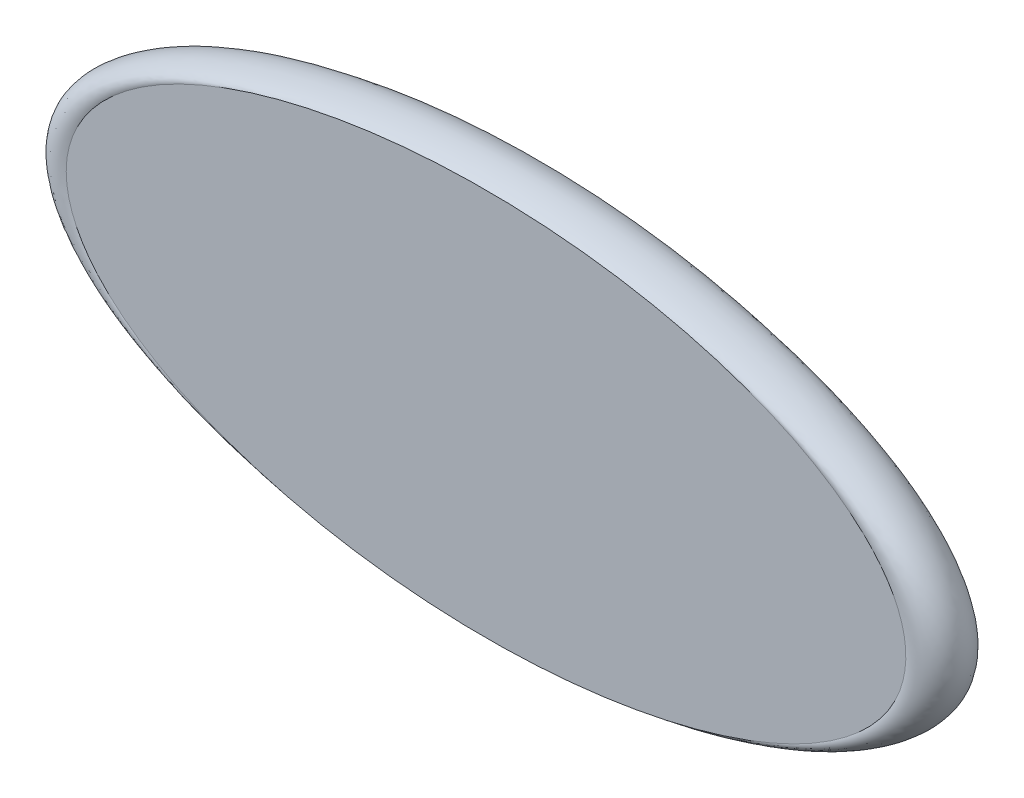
ISO-10303-21;
HEADER;
FILE_DESCRIPTION(('STEP AP214'),'2;1');
FILE_NAME('part.step','',(''),(''),'','','');
FILE_SCHEMA(('AUTOMOTIVE_DESIGN { 1 0 10303 214 1 1 1 1 }'));
ENDSEC;
DATA;
#1=APPLICATION_CONTEXT('core data for automotive mechanical design processes');
#2=APPLICATION_PROTOCOL_DEFINITION('international standard','automotive_design',2000,#1);
#3=PRODUCT_CONTEXT('',#1,'mechanical');
#4=PRODUCT('Part','Part','',(#3));
#5=PRODUCT_RELATED_PRODUCT_CATEGORY('part','',(#4));
#6=PRODUCT_DEFINITION_FORMATION('','',#4);
#7=PRODUCT_DEFINITION_CONTEXT('part definition',#1,'design');
#8=PRODUCT_DEFINITION('design','',#6,#7);
#9=PRODUCT_DEFINITION_SHAPE('','',#8);
#10=(LENGTH_UNIT() NAMED_UNIT(*) SI_UNIT(.MILLI.,.METRE.));
#11=(NAMED_UNIT(*) PLANE_ANGLE_UNIT() SI_UNIT($,.RADIAN.));
#12=(NAMED_UNIT(*) SI_UNIT($,.STERADIAN.) SOLID_ANGLE_UNIT());
#13=UNCERTAINTY_MEASURE_WITH_UNIT(LENGTH_MEASURE(1.E-05),#10,'distance_accuracy_value','');
#14=(GEOMETRIC_REPRESENTATION_CONTEXT(3) GLOBAL_UNCERTAINTY_ASSIGNED_CONTEXT((#13)) GLOBAL_UNIT_ASSIGNED_CONTEXT((#10,
#11,#12)) REPRESENTATION_CONTEXT('',''));
#15=CARTESIAN_POINT('',(0.,0.,0.));
#16=DIRECTION('',(0.,0.,1.));
#17=DIRECTION('',(1.,0.,0.));
#18=AXIS2_PLACEMENT_3D('',#15,#16,#17);
#19=CARTESIAN_POINT('',(0.,0.,-10.));
#20=DIRECTION('',(0.,0.,1.));
#21=DIRECTION('',(1.,0.,0.));
#22=AXIS2_PLACEMENT_3D('',#19,#20,#21);
#23=PLANE('',#22);
#24=CARTESIAN_POINT('',(0.,0.,-10.));
#25=DIRECTION('',(0.,0.,1.));
#26=DIRECTION('',(-1.,0.,0.));
#27=AXIS2_PLACEMENT_3D('',#24,#25,#26);
#28=ELLIPSE('',#27,80.7958192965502,37.3202862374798);
#29=CARTESIAN_POINT('',(-80.7958192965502,0.,-10.));
#30=VERTEX_POINT('',#29);
#31=EDGE_CURVE('E119',#30,#30,#28,.T.);
#32=ORIENTED_EDGE('',*,*,#31,.F.);
#33=EDGE_LOOP('',(#32));
#34=FACE_BOUND('',#33,.T.);
#35=ADVANCED_FACE('F111',(#34),#23,.F.);
#36=CARTESIAN_POINT('',(0.,0.,0.));
#37=DIRECTION('',(0.,0.,1.));
#38=DIRECTION('',(1.,0.,0.));
#39=AXIS2_PLACEMENT_3D('',#36,#37,#38);
#40=PLANE('',#39);
#41=CARTESIAN_POINT('',(0.,0.,0.));
#42=DIRECTION('',(0.,0.,1.));
#43=DIRECTION('',(-1.,0.,0.));
#44=AXIS2_PLACEMENT_3D('',#41,#42,#43);
#45=ELLIPSE('',#44,80.7958192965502,37.3202862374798);
#46=CARTESIAN_POINT('',(-80.7958192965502,0.,0.));
#47=VERTEX_POINT('',#46);
#48=EDGE_CURVE('E12',#47,#47,#45,.T.);
#49=ORIENTED_EDGE('',*,*,#48,.T.);
#50=EDGE_LOOP('',(#49));
#51=FACE_BOUND('',#50,.T.);
#52=ADVANCED_FACE('F161',(#51),#40,.T.);
#53=CARTESIAN_POINT('',(1.080016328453E-05,37.3202862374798,0.));
#54=CARTESIAN_POINT('',(0.,37.7171900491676,-0.687457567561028));
#55=CARTESIAN_POINT('',(0.,38.1802444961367,-1.77192709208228));
#56=CARTESIAN_POINT('',(0.,38.5330478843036,-3.27708998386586));
#57=CARTESIAN_POINT('',(0.,38.6653491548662,-4.42372321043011));
#58=CARTESIAN_POINT('',(0.,38.6653491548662,-5.57627678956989));
#59=CARTESIAN_POINT('',(0.,38.5330478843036,-6.72291001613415));
#60=CARTESIAN_POINT('',(0.,38.1802444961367,-8.22807290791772));
#61=CARTESIAN_POINT('',(0.,37.7171900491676,-9.31254243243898));
#62=CARTESIAN_POINT('',(1.080016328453E-05,37.3202862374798,-10.));
#63=CARTESIAN_POINT('',(3.997406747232,37.3202862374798,0.));
#64=CARTESIAN_POINT('',(3.99739594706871,37.7171900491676,-0.687457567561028));
#65=CARTESIAN_POINT('',(3.99739594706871,38.1802444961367,-1.77192709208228));
#66=CARTESIAN_POINT('',(3.99739594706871,38.5330478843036,-3.27708998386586));
#67=CARTESIAN_POINT('',(3.99739594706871,38.6653491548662,-4.42372321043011));
#68=CARTESIAN_POINT('',(3.99739594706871,38.6653491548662,-5.57627678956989));
#69=CARTESIAN_POINT('',(3.99739594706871,38.5330478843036,-6.72291001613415));
#70=CARTESIAN_POINT('',(3.99739594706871,38.1802444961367,-8.22807290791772));
#71=CARTESIAN_POINT('',(3.99739594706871,37.7171900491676,-9.31254243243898));
#72=CARTESIAN_POINT('',(3.997406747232,37.3202862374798,-10.));
#73=CARTESIAN_POINT('',(9.99359481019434,37.1155129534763,0.));
#74=CARTESIAN_POINT('',(10.0270209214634,37.5031142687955,-0.661248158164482));
#75=CARTESIAN_POINT('',(10.0796535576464,37.9553158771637,-1.72721169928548));
#76=CARTESIAN_POINT('',(10.1315281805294,38.2998504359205,-3.24404042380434));
#77=CARTESIAN_POINT('',(10.1523010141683,38.4290508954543,-4.41201693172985));
#78=CARTESIAN_POINT('',(10.1523010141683,38.4290508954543,-5.58798306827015));
#79=CARTESIAN_POINT('',(10.1315281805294,38.2998504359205,-6.75595957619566));
#80=CARTESIAN_POINT('',(10.0796535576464,37.9553158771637,-8.27278830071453));
#81=CARTESIAN_POINT('',(10.0270209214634,37.5031142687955,-9.33875184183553));
#82=CARTESIAN_POINT('',(9.99359481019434,37.1155129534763,-10.));
#83=CARTESIAN_POINT('',(17.959671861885,36.4232160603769,0.));
#84=CARTESIAN_POINT('',(18.0878358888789,36.7844603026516,-0.586988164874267));
#85=CARTESIAN_POINT('',(18.2895943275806,37.2059122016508,-1.6005180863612));
#86=CARTESIAN_POINT('',(18.4884470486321,37.5270184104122,-3.15040000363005));
#87=CARTESIAN_POINT('',(18.5680762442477,37.6474332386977,-4.37884914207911));
#88=CARTESIAN_POINT('',(18.5680762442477,37.6474332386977,-5.62115085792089));
#89=CARTESIAN_POINT('',(18.4884470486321,37.5270184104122,-6.84959999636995));
#90=CARTESIAN_POINT('',(18.2895943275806,37.2059122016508,-8.39948191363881));
#91=CARTESIAN_POINT('',(18.0878358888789,36.7844603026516,-9.41301183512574));
#92=CARTESIAN_POINT('',(17.959671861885,36.4232160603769,-10.));
#93=CARTESIAN_POINT('',(23.9114288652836,35.6868782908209,0.));
#94=CARTESIAN_POINT('',(24.1315443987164,36.0225406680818,-0.514912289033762));
#95=CARTESIAN_POINT('',(24.4780425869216,36.4141472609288,-1.47755075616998));
#96=CARTESIAN_POINT('',(24.8195505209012,36.7125141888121,-3.05951371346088));
#97=CARTESIAN_POINT('',(24.9563050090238,36.8244017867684,-4.34665687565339));
#98=CARTESIAN_POINT('',(24.9563050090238,36.8244017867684,-5.65334312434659));
#99=CARTESIAN_POINT('',(24.8195505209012,36.7125141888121,-6.9404862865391));
#100=CARTESIAN_POINT('',(24.4780425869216,36.4141472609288,-8.52244924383));
#101=CARTESIAN_POINT('',(24.1315443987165,36.0225406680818,-9.48508771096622));
#102=CARTESIAN_POINT('',(23.9114288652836,35.6868782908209,-9.99999999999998));
#103=CARTESIAN_POINT('',(29.8309915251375,34.724625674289,0.));
#104=CARTESIAN_POINT('',(30.1597770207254,35.0300549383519,-0.42973170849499));
#105=CARTESIAN_POINT('',(30.6773312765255,35.3863898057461,-1.33222572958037));
#106=CARTESIAN_POINT('',(31.1874317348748,35.6578830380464,-2.95210264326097));
#107=CARTESIAN_POINT('',(31.3916979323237,35.759693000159,-4.30861146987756));
#108=CARTESIAN_POINT('',(31.3916979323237,35.759693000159,-5.69138853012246));
#109=CARTESIAN_POINT('',(31.1874317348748,35.6578830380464,-7.04789735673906));
#110=CARTESIAN_POINT('',(30.6773312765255,35.3863898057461,-8.66777427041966));
#111=CARTESIAN_POINT('',(30.1597770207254,35.0300549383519,-9.57026829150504));
#112=CARTESIAN_POINT('',(29.8309915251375,34.724625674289,-10.));
#113=CARTESIAN_POINT('',(35.7067950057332,33.5229855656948,0.));
#114=CARTESIAN_POINT('',(36.1567893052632,33.7946932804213,-0.334722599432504));
#115=CARTESIAN_POINT('',(36.8651368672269,34.1116866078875,-1.17013243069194));
#116=CARTESIAN_POINT('',(37.563282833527,34.353205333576,-2.83229798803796));
#117=CARTESIAN_POINT('',(37.8428505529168,34.4437748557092,-4.26617620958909));
#118=CARTESIAN_POINT('',(37.8428505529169,34.4437748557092,-5.73382379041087));
#119=CARTESIAN_POINT('',(37.563282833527,34.353205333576,-7.16770201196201));
#120=CARTESIAN_POINT('',(36.8651368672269,34.1116866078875,-8.82986756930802));
#121=CARTESIAN_POINT('',(36.1567893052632,33.7946932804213,-9.66527740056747));
#122=CARTESIAN_POINT('',(35.7067950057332,33.5229855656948,-9.99999999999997));
#123=CARTESIAN_POINT('',(41.5244596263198,32.0645053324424,0.));
#124=CARTESIAN_POINT('',(42.10402195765,32.3001658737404,-0.233161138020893));
#125=CARTESIAN_POINT('',(43.0163209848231,32.5751044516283,-0.996860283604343));
#126=CARTESIAN_POINT('',(43.9154811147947,32.7845814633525,-2.70423094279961));
#127=CARTESIAN_POINT('',(44.2755435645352,32.863135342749,-4.22081437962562));
#128=CARTESIAN_POINT('',(44.2755435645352,32.863135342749,-5.77918562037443));
#129=CARTESIAN_POINT('',(43.9154811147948,32.7845814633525,-7.29576905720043));
#130=CARTESIAN_POINT('',(43.0163209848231,32.5751044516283,-9.00313971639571));
#131=CARTESIAN_POINT('',(42.10402195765,32.3001658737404,-9.76683886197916));
#132=CARTESIAN_POINT('',(41.5244596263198,32.0645053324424,-10.));
#133=CARTESIAN_POINT('',(47.2649452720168,30.3257568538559,0.));
#134=CARTESIAN_POINT('',(47.9782552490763,30.5242074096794,-0.128323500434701));
#135=CARTESIAN_POINT('',(49.1010848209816,30.7557346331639,-0.817998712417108));
#136=CARTESIAN_POINT('',(50.2077434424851,30.9321363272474,-2.57203270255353));
#137=CARTESIAN_POINT('',(50.6508972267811,30.9982869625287,-4.17398926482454));
#138=CARTESIAN_POINT('',(50.6508972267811,30.9982869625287,-5.82601073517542));
#139=CARTESIAN_POINT('',(50.2077434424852,30.9321363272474,-7.42796729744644));
#140=CARTESIAN_POINT('',(49.1010848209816,30.7557346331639,-9.18200128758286));
#141=CARTESIAN_POINT('',(47.9782552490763,30.5242074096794,-9.87167649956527));
#142=CARTESIAN_POINT('',(47.2649452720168,30.3257568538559,-9.99999999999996));
#143=CARTESIAN_POINT('',(52.9025180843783,28.2758118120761,0.));
#144=CARTESIAN_POINT('',(53.749575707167,28.437052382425,-0.0234858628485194));
#145=CARTESIAN_POINT('',(55.0829358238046,28.6251682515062,-0.639137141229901));
#146=CARTESIAN_POINT('',(56.3970929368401,28.768494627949,-2.43983446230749));
#147=CARTESIAN_POINT('',(56.9233380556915,28.8222420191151,-4.12716415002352));
#148=CARTESIAN_POINT('',(56.9233380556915,28.8222420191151,-5.8728358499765));
#149=CARTESIAN_POINT('',(56.3970929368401,28.768494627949,-7.56016553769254));
#150=CARTESIAN_POINT('',(55.0829358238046,28.6251682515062,-9.36086285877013));
#151=CARTESIAN_POINT('',(53.749575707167,28.437052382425,-9.97651413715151));
#152=CARTESIAN_POINT('',(52.9025180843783,28.2758118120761,-10.));
#153=CARTESIAN_POINT('',(58.4000849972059,25.8735671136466,0.));
#154=CARTESIAN_POINT('',(59.3767106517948,25.9987605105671,0.0780755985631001));
#155=CARTESIAN_POINT('',(60.9140222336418,26.14482163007,-0.465864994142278));
#156=CARTESIAN_POINT('',(62.4291935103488,26.2561062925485,-2.31176741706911));
#157=CARTESIAN_POINT('',(63.0359333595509,26.2978380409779,-4.08180232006));
#158=CARTESIAN_POINT('',(63.0359333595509,26.2978380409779,-5.91819767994));
#159=CARTESIAN_POINT('',(62.4291935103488,26.2561062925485,-7.68823258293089));
#160=CARTESIAN_POINT('',(60.9140222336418,26.14482163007,-9.53413500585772));
#161=CARTESIAN_POINT('',(59.3767106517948,25.9987605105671,-10.0780755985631));
#162=CARTESIAN_POINT('',(58.4000849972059,25.8735671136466,-10.));
#163=CARTESIAN_POINT('',(63.7030995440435,23.0637889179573,0.));
#164=CARTESIAN_POINT('',(64.8009340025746,23.1552607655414,0.173084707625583));
#165=CARTESIAN_POINT('',(66.5290388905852,23.2619803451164,-0.303771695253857));
#166=CARTESIAN_POINT('',(68.232255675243,23.343290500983,-2.19196276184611));
#167=CARTESIAN_POINT('',(68.914297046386,23.3737818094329,-4.03936705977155));
#168=CARTESIAN_POINT('',(68.914297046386,23.3737818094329,-5.96063294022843));
#169=CARTESIAN_POINT('',(68.232255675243,23.343290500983,-7.80803723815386));
#170=CARTESIAN_POINT('',(66.5290388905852,23.2619803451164,-9.69622830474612));
#171=CARTESIAN_POINT('',(64.8009340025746,23.1552607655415,-10.1730847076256));
#172=CARTESIAN_POINT('',(63.7030995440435,23.0637889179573,-9.99999999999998));
#173=CARTESIAN_POINT('',(68.7245389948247,19.7727116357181,0.));
#174=CARTESIAN_POINT('',(69.9310434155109,19.8339503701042,0.258265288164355));
#175=CARTESIAN_POINT('',(71.8302043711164,19.9053982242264,-0.15844666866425));
#176=CARTESIAN_POINT('',(73.7020136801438,19.9598346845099,-2.0845516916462));
#177=CARTESIAN_POINT('',(74.4515667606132,19.9802483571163,-4.00132165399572));
#178=CARTESIAN_POINT('',(74.4515667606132,19.9802483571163,-5.9986783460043));
#179=CARTESIAN_POINT('',(73.7020136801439,19.9598346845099,-7.91544830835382));
#180=CARTESIAN_POINT('',(71.8302043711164,19.9053982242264,-9.84155333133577));
#181=CARTESIAN_POINT('',(69.9310434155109,19.8339503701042,-10.2582652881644));
#182=CARTESIAN_POINT('',(68.7245389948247,19.7727116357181,-10.));
#183=CARTESIAN_POINT('',(72.5568390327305,16.5474532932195,0.));
#184=CARTESIAN_POINT('',(73.8399697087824,16.5873738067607,0.318328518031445));
#185=CARTESIAN_POINT('',(75.8597471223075,16.6339505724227,-0.0559738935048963));
#186=CARTESIAN_POINT('',(77.8504357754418,16.6694376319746,-2.00881311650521));
#187=CARTESIAN_POINT('',(78.6475932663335,16.6827452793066,-3.9744947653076));
#188=CARTESIAN_POINT('',(78.6475932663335,16.6827452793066,-6.02550523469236));
#189=CARTESIAN_POINT('',(77.8504357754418,16.6694376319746,-7.99118688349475));
#190=CARTESIAN_POINT('',(75.8597471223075,16.6339505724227,-9.94402610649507));
#191=CARTESIAN_POINT('',(73.8399697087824,16.5873738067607,-10.3183285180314));
#192=CARTESIAN_POINT('',(72.5568390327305,16.5474532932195,-9.99999999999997));
#193=CARTESIAN_POINT('',(75.2859482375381,13.6201304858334,0.));
#194=CARTESIAN_POINT('',(76.61993088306,13.645903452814,0.358188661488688));
#195=CARTESIAN_POINT('',(78.7197537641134,13.6759748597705,0.012030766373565));
#196=CARTESIAN_POINT('',(80.7893350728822,13.6988864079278,-1.95855024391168));
#197=CARTESIAN_POINT('',(81.6180845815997,13.7074782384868,-3.95669146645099));
#198=CARTESIAN_POINT('',(81.6180845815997,13.7074782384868,-6.04330853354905));
#199=CARTESIAN_POINT('',(80.7893350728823,13.6988864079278,-8.04144975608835));
#200=CARTESIAN_POINT('',(78.7197537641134,13.6759748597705,-10.0120307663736));
#201=CARTESIAN_POINT('',(76.61993088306,13.645903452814,-10.3581886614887));
#202=CARTESIAN_POINT('',(75.2859482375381,13.6201304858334,-10.));
#203=CARTESIAN_POINT('',(77.1133185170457,11.2387759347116,0.));
#204=CARTESIAN_POINT('',(78.4796931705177,11.2555371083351,0.383579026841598));
#205=CARTESIAN_POINT('',(80.6305039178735,11.275094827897,0.0553488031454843));
#206=CARTESIAN_POINT('',(82.7503387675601,11.2899959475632,-1.92653348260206));
#207=CARTESIAN_POINT('',(83.5992119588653,11.2955838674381,-3.94535100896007));
#208=CARTESIAN_POINT('',(83.5992119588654,11.2955838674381,-6.05464899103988));
#209=CARTESIAN_POINT('',(82.7503387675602,11.2899959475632,-8.07346651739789));
#210=CARTESIAN_POINT('',(80.6305039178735,11.275094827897,-10.0553488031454));
#211=CARTESIAN_POINT('',(78.4796931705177,11.2555371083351,-10.3835790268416));
#212=CARTESIAN_POINT('',(77.1133185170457,11.2387759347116,-9.99999999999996));
#213=CARTESIAN_POINT('',(78.6626082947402,8.66527854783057,0.));
#214=CARTESIAN_POINT('',(80.0551055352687,8.67477214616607,0.404055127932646));
#215=CARTESIAN_POINT('',(82.2470355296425,8.68585108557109,0.0902827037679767));
#216=CARTESIAN_POINT('',(84.4073974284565,8.69429218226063,-1.90071351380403));
#217=CARTESIAN_POINT('',(85.2724993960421,8.69745759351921,-3.93620547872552));
#218=CARTESIAN_POINT('',(85.2724993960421,8.69745759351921,-6.06379452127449));
#219=CARTESIAN_POINT('',(84.4073974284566,8.69429218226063,-8.09928648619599));
#220=CARTESIAN_POINT('',(82.2470355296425,8.68585108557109,-10.090282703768));
#221=CARTESIAN_POINT('',(80.0551055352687,8.67477214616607,-10.4040551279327));
#222=CARTESIAN_POINT('',(78.6626082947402,8.66527854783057,-10.));
#223=CARTESIAN_POINT('',(79.8580507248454,5.90764025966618,0.));
#224=CARTESIAN_POINT('',(81.2698786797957,5.91175585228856,0.419207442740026));
#225=CARTESIAN_POINT('',(83.4922369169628,5.91656049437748,0.116133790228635));
#226=CARTESIAN_POINT('',(85.682588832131,5.92022117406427,-1.88160673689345));
#227=CARTESIAN_POINT('',(86.5597000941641,5.92159392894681,-3.92943778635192));
#228=CARTESIAN_POINT('',(86.5597000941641,5.92159392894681,-6.07056221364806));
#229=CARTESIAN_POINT('',(85.6825888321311,5.92022117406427,-8.11839326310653));
#230=CARTESIAN_POINT('',(83.4922369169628,5.91656049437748,-10.1161337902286));
#231=CARTESIAN_POINT('',(81.2698786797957,5.91175585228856,-10.41920744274));
#232=CARTESIAN_POINT('',(79.8580507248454,5.90764025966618,-9.99999999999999));
#233=CARTESIAN_POINT('',(80.6206831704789,2.99790398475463,0.));
#234=CARTESIAN_POINT('',(82.0445275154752,2.99867649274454,0.428626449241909));
#235=CARTESIAN_POINT('',(84.2858006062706,2.99958089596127,0.132203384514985));
#236=CARTESIAN_POINT('',(86.4947949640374,3.00026996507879,-1.86972955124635));
#237=CARTESIAN_POINT('',(87.3793714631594,3.00052836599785,-3.92523084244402));
#238=CARTESIAN_POINT('',(87.3793714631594,3.00052836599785,-6.07476915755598));
#239=CARTESIAN_POINT('',(86.4947949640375,3.00026996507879,-8.13027044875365));
#240=CARTESIAN_POINT('',(84.2858006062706,2.99958089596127,-10.132203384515));
#241=CARTESIAN_POINT('',(82.0445275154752,2.99867649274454,-10.4286264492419));
#242=CARTESIAN_POINT('',(80.6206831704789,2.99790398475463,-10.));
#243=CARTESIAN_POINT('',(80.7958192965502,0.99935168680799,0.));
#244=CARTESIAN_POINT('',(82.2224500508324,0.999348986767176,0.430810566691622));
#245=CARTESIAN_POINT('',(84.4681091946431,0.999348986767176,0.135929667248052));
#246=CARTESIAN_POINT('',(86.6814264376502,0.999348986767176,-1.86697542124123));
#247=CARTESIAN_POINT('',(87.5677340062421,0.999348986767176,-3.924255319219));
#248=CARTESIAN_POINT('',(87.5677340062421,0.999348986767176,-6.075744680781));
#249=CARTESIAN_POINT('',(86.6814264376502,0.999348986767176,-8.13302457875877));
#250=CARTESIAN_POINT('',(84.4681091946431,0.999348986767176,-10.135929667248));
#251=CARTESIAN_POINT('',(82.2224500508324,0.999348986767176,-10.4308105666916));
#252=CARTESIAN_POINT('',(80.7958192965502,0.99935168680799,-10.));
#253=CARTESIAN_POINT('',(80.7958192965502,-0.999351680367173,0.));
#254=CARTESIAN_POINT('',(82.2224500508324,-0.999354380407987,0.430810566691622));
#255=CARTESIAN_POINT('',(84.4681091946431,-0.999354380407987,0.135929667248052));
#256=CARTESIAN_POINT('',(86.6814264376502,-0.999354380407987,-1.86697542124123));
#257=CARTESIAN_POINT('',(87.5677340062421,-0.999354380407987,-3.924255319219));
#258=CARTESIAN_POINT('',(87.5677340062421,-0.999354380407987,-6.075744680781));
#259=CARTESIAN_POINT('',(86.6814264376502,-0.999354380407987,-8.13302457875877));
#260=CARTESIAN_POINT('',(84.4681091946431,-0.999354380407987,-10.135929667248));
#261=CARTESIAN_POINT('',(82.2224500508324,-0.999354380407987,-10.4308105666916));
#262=CARTESIAN_POINT('',(80.7958192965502,-0.999351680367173,-10.));
#263=CARTESIAN_POINT('',(80.6206831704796,-2.99790398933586,0.));
#264=CARTESIAN_POINT('',(82.0445275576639,-2.99868188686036,0.42862644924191));
#265=CARTESIAN_POINT('',(84.2858006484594,-2.9995862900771,0.132203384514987));
#266=CARTESIAN_POINT('',(86.4947950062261,-3.00027535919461,-1.86972955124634));
#267=CARTESIAN_POINT('',(87.3793715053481,-3.00053376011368,-3.92523084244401));
#268=CARTESIAN_POINT('',(87.3793715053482,-3.00053376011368,-6.07476915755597));
#269=CARTESIAN_POINT('',(86.4947950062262,-3.00027535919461,-8.13027044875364));
#270=CARTESIAN_POINT('',(84.2858006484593,-2.9995862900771,-10.132203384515));
#271=CARTESIAN_POINT('',(82.0445275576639,-2.99868188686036,-10.4286264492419));
#272=CARTESIAN_POINT('',(80.6206831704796,-2.99790398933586,-9.99999999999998));
#273=CARTESIAN_POINT('',(79.8580507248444,-5.90764025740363,0.));
#274=CARTESIAN_POINT('',(81.2698789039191,-5.91176119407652,0.419207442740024));
#275=CARTESIAN_POINT('',(83.4922371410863,-5.91656583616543,0.116133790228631));
#276=CARTESIAN_POINT('',(85.6825890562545,-5.92022651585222,-1.88160673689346));
#277=CARTESIAN_POINT('',(86.5597003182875,-5.92159927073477,-3.92943778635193));
#278=CARTESIAN_POINT('',(86.5597003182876,-5.92159927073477,-6.07056221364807));
#279=CARTESIAN_POINT('',(85.6825890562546,-5.92022651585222,-8.11839326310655));
#280=CARTESIAN_POINT('',(83.4922371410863,-5.91656583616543,-10.1161337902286));
#281=CARTESIAN_POINT('',(81.2698789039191,-5.91176119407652,-10.41920744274));
#282=CARTESIAN_POINT('',(79.8580507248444,-5.90764025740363,-10.));
#283=CARTESIAN_POINT('',(78.6626082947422,-8.66527854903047,0.));
#284=CARTESIAN_POINT('',(80.0551060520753,-8.67477741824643,0.404055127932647));
#285=CARTESIAN_POINT('',(82.2470360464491,-8.68585635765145,0.0902827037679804));
#286=CARTESIAN_POINT('',(84.4073979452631,-8.69429745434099,-1.90071351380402));
#287=CARTESIAN_POINT('',(85.2724999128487,-8.69746286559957,-3.93620547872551));
#288=CARTESIAN_POINT('',(85.2724999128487,-8.69746286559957,-6.06379452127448));
#289=CARTESIAN_POINT('',(84.4073979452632,-8.69429745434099,-8.09928648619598));
#290=CARTESIAN_POINT('',(82.2470360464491,-8.68585635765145,-10.090282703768));
#291=CARTESIAN_POINT('',(80.0551060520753,-8.67477741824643,-10.4040551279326));
#292=CARTESIAN_POINT('',(78.6626082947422,-8.66527854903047,-9.99999999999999));
#293=CARTESIAN_POINT('',(77.1133185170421,-11.2387759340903,0.));
#294=CARTESIAN_POINT('',(78.4796940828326,-11.2555422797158,0.383579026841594));
#295=CARTESIAN_POINT('',(80.6305048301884,-11.2750999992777,0.0553488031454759));
#296=CARTESIAN_POINT('',(82.7503396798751,-11.290001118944,-1.92653348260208));
#297=CARTESIAN_POINT('',(83.5992128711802,-11.2955890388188,-3.94535100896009));
#298=CARTESIAN_POINT('',(83.5992128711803,-11.2955890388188,-6.0546489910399));
#299=CARTESIAN_POINT('',(82.7503396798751,-11.290001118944,-8.07346651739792));
#300=CARTESIAN_POINT('',(80.6305048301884,-11.2750999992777,-10.0553488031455));
#301=CARTESIAN_POINT('',(78.4796940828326,-11.2555422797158,-10.3835790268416));
#302=CARTESIAN_POINT('',(77.1133185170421,-11.2387759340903,-10.));
#303=CARTESIAN_POINT('',(75.2859482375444,-13.6201304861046,0.));
#304=CARTESIAN_POINT('',(76.6199322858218,-13.6459085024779,0.358188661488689));
#305=CARTESIAN_POINT('',(78.7197551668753,-13.6759799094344,0.0120307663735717));
#306=CARTESIAN_POINT('',(80.7893364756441,-13.6988914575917,-1.95855024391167));
#307=CARTESIAN_POINT('',(81.6180859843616,-13.7074832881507,-3.95669146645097));
#308=CARTESIAN_POINT('',(81.6180859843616,-13.7074832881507,-6.04330853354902));
#309=CARTESIAN_POINT('',(80.7893364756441,-13.6988914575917,-8.04144975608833));
#310=CARTESIAN_POINT('',(78.7197551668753,-13.6759799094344,-10.0120307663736));
#311=CARTESIAN_POINT('',(76.6199322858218,-13.6459085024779,-10.3581886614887));
#312=CARTESIAN_POINT('',(75.2859482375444,-13.6201304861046,-9.99999999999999));
#313=CARTESIAN_POINT('',(72.5568390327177,-16.547453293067,0.));
#314=CARTESIAN_POINT('',(73.8399718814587,-16.5873786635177,0.318328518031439));
#315=CARTESIAN_POINT('',(75.8597492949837,-16.6339554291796,-0.0559738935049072));
#316=CARTESIAN_POINT('',(77.850437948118,-16.6694424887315,-2.00881311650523));
#317=CARTESIAN_POINT('',(78.6475954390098,-16.6827501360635,-3.97449476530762));
#318=CARTESIAN_POINT('',(78.6475954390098,-16.6827501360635,-6.02550523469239));
#319=CARTESIAN_POINT('',(77.8504379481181,-16.6694424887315,-7.99118688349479));
#320=CARTESIAN_POINT('',(75.8597492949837,-16.6339554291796,-9.94402610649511));
#321=CARTESIAN_POINT('',(73.8399718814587,-16.5873786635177,-10.3183285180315));
#322=CARTESIAN_POINT('',(72.5568390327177,-16.547453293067,-10.));
#323=CARTESIAN_POINT('',(68.7245389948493,-19.772711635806,0.));
#324=CARTESIAN_POINT('',(69.9310467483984,-19.833954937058,0.258265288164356));
#325=CARTESIAN_POINT('',(71.8302077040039,-19.9054027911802,-0.158446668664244));
#326=CARTESIAN_POINT('',(73.7020170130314,-19.9598392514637,-2.08455169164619));
#327=CARTESIAN_POINT('',(74.4515700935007,-19.9802529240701,-4.0013216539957));
#328=CARTESIAN_POINT('',(74.4515700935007,-19.9802529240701,-5.99867834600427));
#329=CARTESIAN_POINT('',(73.7020170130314,-19.9598392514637,-7.91544830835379));
#330=CARTESIAN_POINT('',(71.8302077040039,-19.9054027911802,-9.84155333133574));
#331=CARTESIAN_POINT('',(69.9310467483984,-19.833954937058,-10.2582652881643));
#332=CARTESIAN_POINT('',(68.7245389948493,-19.772711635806,-9.99999999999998));
#333=CARTESIAN_POINT('',(63.7030995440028,-23.0637889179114,0.));
#334=CARTESIAN_POINT('',(64.8009389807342,-23.1552649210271,0.173084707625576));
#335=CARTESIAN_POINT('',(66.5290438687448,-23.261984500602,-0.303771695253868));
#336=CARTESIAN_POINT('',(68.2322606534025,-23.3432946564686,-2.19196276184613));
#337=CARTESIAN_POINT('',(68.9143020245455,-23.3737859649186,-4.03936705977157));
#338=CARTESIAN_POINT('',(68.9143020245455,-23.3737859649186,-5.96063294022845));
#339=CARTESIAN_POINT('',(68.2322606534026,-23.3432946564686,-7.8080372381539));
#340=CARTESIAN_POINT('',(66.5290438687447,-23.261984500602,-9.69622830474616));
#341=CARTESIAN_POINT('',(64.8009389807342,-23.1552649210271,-10.1730847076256));
#342=CARTESIAN_POINT('',(63.7030995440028,-23.0637889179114,-10.));
#343=CARTESIAN_POINT('',(58.400084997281,-25.8735671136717,0.));
#344=CARTESIAN_POINT('',(59.3767174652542,-25.9987642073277,0.0780755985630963));
#345=CARTESIAN_POINT('',(60.9140290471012,-26.1448253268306,-0.465864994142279));
#346=CARTESIAN_POINT('',(62.4292003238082,-26.2561099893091,-2.31176741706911));
#347=CARTESIAN_POINT('',(63.0359401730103,-26.2978417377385,-4.08180232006));
#348=CARTESIAN_POINT('',(63.0359401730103,-26.2978417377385,-5.91819767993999));
#349=CARTESIAN_POINT('',(62.4292003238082,-26.2561099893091,-7.68823258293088));
#350=CARTESIAN_POINT('',(60.9140290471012,-26.1448253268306,-9.53413500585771));
#351=CARTESIAN_POINT('',(59.3767174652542,-25.9987642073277,-10.0780755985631));
#352=CARTESIAN_POINT('',(58.400084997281,-25.8735671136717,-9.99999999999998));
#353=CARTESIAN_POINT('',(52.9025180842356,-28.2758118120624,0.));
#354=CARTESIAN_POINT('',(53.749584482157,-28.4370555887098,-0.0234858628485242));
#355=CARTESIAN_POINT('',(55.0829445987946,-28.625171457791,-0.639137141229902));
#356=CARTESIAN_POINT('',(56.3971017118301,-28.7684978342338,-2.43983446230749));
#357=CARTESIAN_POINT('',(56.9233468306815,-28.8222452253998,-4.12716415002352));
#358=CARTESIAN_POINT('',(56.9233468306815,-28.8222452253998,-5.87283584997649));
#359=CARTESIAN_POINT('',(56.3971017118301,-28.7684978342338,-7.56016553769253));
#360=CARTESIAN_POINT('',(55.0829445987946,-28.625171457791,-9.36086285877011));
#361=CARTESIAN_POINT('',(53.749584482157,-28.4370555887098,-9.97651413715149));
#362=CARTESIAN_POINT('',(52.9025180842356,-28.2758118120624,-10.));
#363=CARTESIAN_POINT('',(47.264945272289,-30.3257568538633,0.));
#364=CARTESIAN_POINT('',(47.9782660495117,-30.5242101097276,-0.12832350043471));
#365=CARTESIAN_POINT('',(49.1010956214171,-30.7557373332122,-0.817998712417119));
#366=CARTESIAN_POINT('',(50.2077542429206,-30.9321390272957,-2.57203270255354));
#367=CARTESIAN_POINT('',(50.6509080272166,-30.998289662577,-4.17398926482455));
#368=CARTESIAN_POINT('',(50.6509080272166,-30.998289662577,-5.82601073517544));
#369=CARTESIAN_POINT('',(50.2077542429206,-30.9321390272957,-7.42796729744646));
#370=CARTESIAN_POINT('',(49.1010956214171,-30.7557373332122,-9.18200128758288));
#371=CARTESIAN_POINT('',(47.9782660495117,-30.5242101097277,-9.87167649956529));
#372=CARTESIAN_POINT('',(47.264945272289,-30.3257568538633,-9.99999999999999));
#373=CARTESIAN_POINT('',(41.5244596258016,-32.0645053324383,0.));
#374=CARTESIAN_POINT('',(42.1040347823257,-32.3001680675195,-0.233161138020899));
#375=CARTESIAN_POINT('',(43.0163338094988,-32.5751066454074,-0.996860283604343));
#376=CARTESIAN_POINT('',(43.9154939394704,-32.7845836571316,-2.70423094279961));
#377=CARTESIAN_POINT('',(44.2755563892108,-32.8631375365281,-4.22081437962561));
#378=CARTESIAN_POINT('',(44.2755563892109,-32.8631375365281,-5.77918562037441));
#379=CARTESIAN_POINT('',(43.9154939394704,-32.7845836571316,-7.29576905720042));
#380=CARTESIAN_POINT('',(43.0163338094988,-32.5751066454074,-9.00313971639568));
#381=CARTESIAN_POINT('',(42.1040347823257,-32.3001680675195,-9.76683886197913));
#382=CARTESIAN_POINT('',(41.5244596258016,-32.0645053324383,-10.));
#383=CARTESIAN_POINT('',(35.7067950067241,-33.522985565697,0.));
#384=CARTESIAN_POINT('',(36.1568040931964,-33.7946949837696,-0.334722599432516));
#385=CARTESIAN_POINT('',(36.8651516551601,-34.1116883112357,-1.17013243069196));
#386=CARTESIAN_POINT('',(37.5632976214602,-34.3532070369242,-2.83229798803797));
#387=CARTESIAN_POINT('',(37.84286534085,-34.4437765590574,-4.2661762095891));
#388=CARTESIAN_POINT('',(37.84286534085,-34.4437765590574,-5.73382379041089));
#389=CARTESIAN_POINT('',(37.5632976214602,-34.3532070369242,-7.16770201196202));
#390=CARTESIAN_POINT('',(36.8651516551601,-34.1116883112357,-8.82986756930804));
#391=CARTESIAN_POINT('',(36.1568040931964,-33.7946949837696,-9.66527740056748));
#392=CARTESIAN_POINT('',(35.7067950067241,-33.522985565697,-9.99999999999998));
#393=CARTESIAN_POINT('',(29.8309915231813,-34.7246256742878,0.));
#394=CARTESIAN_POINT('',(30.1597936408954,-35.0300561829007,-0.429731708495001));
#395=CARTESIAN_POINT('',(30.6773478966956,-35.3863910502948,-1.33222572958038));
#396=CARTESIAN_POINT('',(31.1874483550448,-35.6578842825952,-2.95210264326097));
#397=CARTESIAN_POINT('',(31.3917145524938,-35.7596942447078,-4.30861146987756));
#398=CARTESIAN_POINT('',(31.3917145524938,-35.7596942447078,-5.69138853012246));
#399=CARTESIAN_POINT('',(31.1874483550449,-35.6578842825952,-7.04789735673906));
#400=CARTESIAN_POINT('',(30.6773478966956,-35.3863910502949,-8.66777427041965));
#401=CARTESIAN_POINT('',(30.1597936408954,-35.0300561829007,-9.57026829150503));
#402=CARTESIAN_POINT('',(29.8309915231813,-34.7246256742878,-10.));
#403=CARTESIAN_POINT('',(23.9114288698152,-35.6868782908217,0.));
#404=CARTESIAN_POINT('',(24.1315626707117,-36.0225415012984,-0.514912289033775));
#405=CARTESIAN_POINT('',(24.4780608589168,-36.4141480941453,-1.47755075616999));
#406=CARTESIAN_POINT('',(24.8195687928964,-36.7125150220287,-3.05951371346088));
#407=CARTESIAN_POINT('',(24.956323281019,-36.8244026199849,-4.34665687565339));
#408=CARTESIAN_POINT('',(24.956323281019,-36.8244026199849,-5.65334312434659));
#409=CARTESIAN_POINT('',(24.8195687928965,-36.7125150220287,-6.9404862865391));
#410=CARTESIAN_POINT('',(24.4780608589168,-36.4141480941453,-8.52244924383));
#411=CARTESIAN_POINT('',(24.1315626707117,-36.0225415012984,-9.48508771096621));
#412=CARTESIAN_POINT('',(23.9114288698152,-35.6868782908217,-9.99999999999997));
#413=CARTESIAN_POINT('',(17.9596718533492,-36.4232160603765,0.));
#414=CARTESIAN_POINT('',(18.0878555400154,-36.7844607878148,-0.586988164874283));
#415=CARTESIAN_POINT('',(18.2896139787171,-37.205912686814,-1.60051808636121));
#416=CARTESIAN_POINT('',(18.4884666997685,-37.5270188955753,-3.15040000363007));
#417=CARTESIAN_POINT('',(18.5680958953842,-37.6474337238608,-4.37884914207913));
#418=CARTESIAN_POINT('',(18.5680958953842,-37.6474337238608,-5.62115085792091));
#419=CARTESIAN_POINT('',(18.4884666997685,-37.5270188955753,-6.84959999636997));
#420=CARTESIAN_POINT('',(18.2896139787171,-37.205912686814,-8.39948191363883));
#421=CARTESIAN_POINT('',(18.0878555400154,-36.7844607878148,-9.41301183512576));
#422=CARTESIAN_POINT('',(17.9596718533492,-36.4232160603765,-10.));
#423=CARTESIAN_POINT('',(9.99359482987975,-37.1155129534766,0.));
#424=CARTESIAN_POINT('',(10.0270420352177,-37.5031143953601,-0.661248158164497));
#425=CARTESIAN_POINT('',(10.0796746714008,-37.9553160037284,-1.72721169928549));
#426=CARTESIAN_POINT('',(10.1315492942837,-38.2998505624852,-3.24404042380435));
#427=CARTESIAN_POINT('',(10.1523221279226,-38.429051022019,-4.41201693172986));
#428=CARTESIAN_POINT('',(10.1523221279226,-38.429051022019,-5.58798306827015));
#429=CARTESIAN_POINT('',(10.1315492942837,-38.2998505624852,-6.75595957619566));
#430=CARTESIAN_POINT('',(10.0796746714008,-37.9553160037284,-8.27278830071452));
#431=CARTESIAN_POINT('',(10.0270420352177,-37.5031143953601,-9.33875184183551));
#432=CARTESIAN_POINT('',(9.99359482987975,-37.1155129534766,-9.99999999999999));
#433=CARTESIAN_POINT('',(3.99740672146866,-37.3202862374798,0.));
#434=CARTESIAN_POINT('',(3.99741752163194,-37.7171900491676,-0.687457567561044));
#435=CARTESIAN_POINT('',(3.99741752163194,-38.1802444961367,-1.77192709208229));
#436=CARTESIAN_POINT('',(3.99741752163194,-38.5330478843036,-3.27708998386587));
#437=CARTESIAN_POINT('',(3.99741752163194,-38.6653491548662,-4.42372321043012));
#438=CARTESIAN_POINT('',(3.99741752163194,-38.6653491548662,-5.5762767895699));
#439=CARTESIAN_POINT('',(3.99741752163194,-38.5330478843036,-6.72291001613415));
#440=CARTESIAN_POINT('',(3.99741752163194,-38.1802444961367,-8.22807290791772));
#441=CARTESIAN_POINT('',(3.99741752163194,-37.7171900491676,-9.31254243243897));
#442=CARTESIAN_POINT('',(3.99740672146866,-37.3202862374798,-10.));
#443=CARTESIAN_POINT('',(-3.99740674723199,-37.3202862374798,0.));
#444=CARTESIAN_POINT('',(-3.99739594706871,-37.7171900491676,-0.687457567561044));
#445=CARTESIAN_POINT('',(-3.99739594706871,-38.1802444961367,-1.77192709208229));
#446=CARTESIAN_POINT('',(-3.99739594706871,-38.5330478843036,-3.27708998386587));
#447=CARTESIAN_POINT('',(-3.99739594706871,-38.6653491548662,-4.42372321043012));
#448=CARTESIAN_POINT('',(-3.99739594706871,-38.6653491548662,-5.5762767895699));
#449=CARTESIAN_POINT('',(-3.99739594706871,-38.5330478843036,-6.72291001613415));
#450=CARTESIAN_POINT('',(-3.99739594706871,-38.1802444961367,-8.22807290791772));
#451=CARTESIAN_POINT('',(-3.99739594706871,-37.7171900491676,-9.31254243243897));
#452=CARTESIAN_POINT('',(-3.99740674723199,-37.3202862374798,-10.));
#453=CARTESIAN_POINT('',(-9.99359481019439,-37.1155129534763,0.));
#454=CARTESIAN_POINT('',(-10.0270209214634,-37.5031142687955,-0.661248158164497));
#455=CARTESIAN_POINT('',(-10.0796535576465,-37.9553158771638,-1.72721169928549));
#456=CARTESIAN_POINT('',(-10.1315281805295,-38.2998504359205,-3.24404042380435));
#457=CARTESIAN_POINT('',(-10.1523010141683,-38.4290508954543,-4.41201693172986));
#458=CARTESIAN_POINT('',(-10.1523010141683,-38.4290508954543,-5.58798306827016));
#459=CARTESIAN_POINT('',(-10.1315281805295,-38.2998504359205,-6.75595957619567));
#460=CARTESIAN_POINT('',(-10.0796535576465,-37.9553158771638,-8.27278830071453));
#461=CARTESIAN_POINT('',(-10.0270209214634,-37.5031142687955,-9.33875184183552));
#462=CARTESIAN_POINT('',(-9.99359481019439,-37.1155129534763,-10.));
#463=CARTESIAN_POINT('',(-17.9596718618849,-36.4232160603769,0.));
#464=CARTESIAN_POINT('',(-18.0878358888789,-36.7844603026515,-0.586988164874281));
#465=CARTESIAN_POINT('',(-18.2895943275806,-37.2059122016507,-1.60051808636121));
#466=CARTESIAN_POINT('',(-18.488447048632,-37.5270184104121,-3.15040000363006));
#467=CARTESIAN_POINT('',(-18.5680762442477,-37.6474332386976,-4.37884914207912));
#468=CARTESIAN_POINT('',(-18.5680762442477,-37.6474332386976,-5.62115085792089));
#469=CARTESIAN_POINT('',(-18.488447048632,-37.5270184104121,-6.84959999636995));
#470=CARTESIAN_POINT('',(-18.2895943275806,-37.2059122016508,-8.39948191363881));
#471=CARTESIAN_POINT('',(-18.0878358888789,-36.7844603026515,-9.41301183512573));
#472=CARTESIAN_POINT('',(-17.9596718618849,-36.4232160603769,-10.));
#473=CARTESIAN_POINT('',(-23.9114288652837,-35.686878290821,0.));
#474=CARTESIAN_POINT('',(-24.1315443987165,-36.0225406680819,-0.514912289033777));
#475=CARTESIAN_POINT('',(-24.4780425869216,-36.4141472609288,-1.47755075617));
#476=CARTESIAN_POINT('',(-24.8195505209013,-36.7125141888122,-3.05951371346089));
#477=CARTESIAN_POINT('',(-24.9563050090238,-36.8244017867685,-4.3466568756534));
#478=CARTESIAN_POINT('',(-24.9563050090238,-36.8244017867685,-5.65334312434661));
#479=CARTESIAN_POINT('',(-24.8195505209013,-36.7125141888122,-6.94048628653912));
#480=CARTESIAN_POINT('',(-24.4780425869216,-36.4141472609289,-8.52244924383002));
#481=CARTESIAN_POINT('',(-24.1315443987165,-36.0225406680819,-9.48508771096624));
#482=CARTESIAN_POINT('',(-23.9114288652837,-35.686878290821,-10.));
#483=CARTESIAN_POINT('',(-29.8309915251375,-34.724625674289,0.));
#484=CARTESIAN_POINT('',(-30.1597770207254,-35.0300549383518,-0.429731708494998));
#485=CARTESIAN_POINT('',(-30.6773312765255,-35.386389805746,-1.33222572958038));
#486=CARTESIAN_POINT('',(-31.1874317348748,-35.6578830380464,-2.95210264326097));
#487=CARTESIAN_POINT('',(-31.3916979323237,-35.759693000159,-4.30861146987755));
#488=CARTESIAN_POINT('',(-31.3916979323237,-35.759693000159,-5.69138853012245));
#489=CARTESIAN_POINT('',(-31.1874317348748,-35.6578830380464,-7.04789735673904));
#490=CARTESIAN_POINT('',(-30.6773312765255,-35.386389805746,-8.66777427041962));
#491=CARTESIAN_POINT('',(-30.1597770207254,-35.0300549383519,-9.570268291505));
#492=CARTESIAN_POINT('',(-29.8309915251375,-34.724625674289,-9.99999999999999));
#493=CARTESIAN_POINT('',(-35.7067950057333,-33.5229855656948,0.));
#494=CARTESIAN_POINT('',(-36.1567893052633,-33.7946932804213,-0.334722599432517));
#495=CARTESIAN_POINT('',(-36.865136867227,-34.1116866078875,-1.17013243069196));
#496=CARTESIAN_POINT('',(-37.5632828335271,-34.353205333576,-2.83229798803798));
#497=CARTESIAN_POINT('',(-37.8428505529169,-34.4437748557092,-4.26617620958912));
#498=CARTESIAN_POINT('',(-37.8428505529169,-34.4437748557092,-5.73382379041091));
#499=CARTESIAN_POINT('',(-37.5632828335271,-34.353205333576,-7.16770201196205));
#500=CARTESIAN_POINT('',(-36.865136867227,-34.1116866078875,-8.82986756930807));
#501=CARTESIAN_POINT('',(-36.1567893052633,-33.7946932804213,-9.66527740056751));
#502=CARTESIAN_POINT('',(-35.7067950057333,-33.5229855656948,-10.));
#503=CARTESIAN_POINT('',(-41.5244596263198,-32.0645053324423,0.));
#504=CARTESIAN_POINT('',(-42.10402195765,-32.3001658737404,-0.233161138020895));
#505=CARTESIAN_POINT('',(-43.0163209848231,-32.5751044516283,-0.996860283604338));
#506=CARTESIAN_POINT('',(-43.9154811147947,-32.7845814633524,-2.7042309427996));
#507=CARTESIAN_POINT('',(-44.2755435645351,-32.8631353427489,-4.22081437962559));
#508=CARTESIAN_POINT('',(-44.2755435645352,-32.8631353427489,-5.7791856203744));
#509=CARTESIAN_POINT('',(-43.9154811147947,-32.7845814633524,-7.29576905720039));
#510=CARTESIAN_POINT('',(-43.0163209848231,-32.5751044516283,-9.00313971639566));
#511=CARTESIAN_POINT('',(-42.10402195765,-32.3001658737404,-9.7668388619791));
#512=CARTESIAN_POINT('',(-41.5244596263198,-32.0645053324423,-9.99999999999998));
#513=CARTESIAN_POINT('',(-47.2649452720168,-30.3257568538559,0.));
#514=CARTESIAN_POINT('',(-47.9782552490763,-30.5242074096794,-0.12832350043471));
#515=CARTESIAN_POINT('',(-49.1010848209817,-30.755734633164,-0.817998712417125));
#516=CARTESIAN_POINT('',(-50.2077434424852,-30.9321363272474,-2.57203270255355));
#517=CARTESIAN_POINT('',(-50.6508972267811,-30.9982869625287,-4.17398926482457));
#518=CARTESIAN_POINT('',(-50.6508972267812,-30.9982869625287,-5.82601073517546));
#519=CARTESIAN_POINT('',(-50.2077434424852,-30.9321363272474,-7.42796729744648));
#520=CARTESIAN_POINT('',(-49.1010848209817,-30.755734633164,-9.1820012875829));
#521=CARTESIAN_POINT('',(-47.9782552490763,-30.5242074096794,-9.87167649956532));
#522=CARTESIAN_POINT('',(-47.2649452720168,-30.3257568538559,-10.));
#523=CARTESIAN_POINT('',(-52.9025180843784,-28.275811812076,0.));
#524=CARTESIAN_POINT('',(-53.7495757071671,-28.4370523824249,-0.0234858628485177));
#525=CARTESIAN_POINT('',(-55.0829358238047,-28.6251682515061,-0.639137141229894));
#526=CARTESIAN_POINT('',(-56.3970929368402,-28.7684946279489,-2.43983446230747));
#527=CARTESIAN_POINT('',(-56.9233380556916,-28.822242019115,-4.1271641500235));
#528=CARTESIAN_POINT('',(-56.9233380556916,-28.822242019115,-5.87283584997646));
#529=CARTESIAN_POINT('',(-56.3970929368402,-28.7684946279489,-7.56016553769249));
#530=CARTESIAN_POINT('',(-55.0829358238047,-28.6251682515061,-9.36086285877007));
#531=CARTESIAN_POINT('',(-53.7495757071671,-28.4370523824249,-9.97651413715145));
#532=CARTESIAN_POINT('',(-52.9025180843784,-28.275811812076,-9.99999999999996));
#533=CARTESIAN_POINT('',(-58.4000849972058,-25.8735671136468,0.));
#534=CARTESIAN_POINT('',(-59.3767106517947,-25.9987605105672,0.0780755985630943));
#535=CARTESIAN_POINT('',(-60.9140222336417,-26.1448216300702,-0.465864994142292));
#536=CARTESIAN_POINT('',(-62.4291935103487,-26.2561062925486,-2.31176741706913));
#537=CARTESIAN_POINT('',(-63.0359333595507,-26.297838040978,-4.08180232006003));
#538=CARTESIAN_POINT('',(-63.0359333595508,-26.297838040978,-5.91819767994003));
#539=CARTESIAN_POINT('',(-62.4291935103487,-26.2561062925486,-7.68823258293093));
#540=CARTESIAN_POINT('',(-60.9140222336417,-26.1448216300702,-9.53413500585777));
#541=CARTESIAN_POINT('',(-59.3767106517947,-25.9987605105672,-10.0780755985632));
#542=CARTESIAN_POINT('',(-58.4000849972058,-25.8735671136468,-10.0000000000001));
#543=CARTESIAN_POINT('',(-63.7030995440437,-23.0637889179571,0.));
#544=CARTESIAN_POINT('',(-64.8009340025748,-23.1552607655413,0.173084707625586));
#545=CARTESIAN_POINT('',(-66.5290388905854,-23.2619803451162,-0.303771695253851));
#546=CARTESIAN_POINT('',(-68.2322556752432,-23.3432905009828,-2.1919627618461));
#547=CARTESIAN_POINT('',(-68.9142970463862,-23.3737818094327,-4.03936705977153));
#548=CARTESIAN_POINT('',(-68.9142970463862,-23.3737818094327,-5.9606329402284));
#549=CARTESIAN_POINT('',(-68.2322556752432,-23.3432905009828,-7.80803723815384));
#550=CARTESIAN_POINT('',(-66.5290388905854,-23.2619803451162,-9.69622830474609));
#551=CARTESIAN_POINT('',(-64.8009340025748,-23.1552607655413,-10.1730847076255));
#552=CARTESIAN_POINT('',(-63.7030995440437,-23.0637889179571,-9.99999999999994));
#553=CARTESIAN_POINT('',(-68.7245389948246,-19.7727116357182,0.));
#554=CARTESIAN_POINT('',(-69.9310434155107,-19.8339503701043,0.258265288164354));
#555=CARTESIAN_POINT('',(-71.8302043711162,-19.9053982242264,-0.158446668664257));
#556=CARTESIAN_POINT('',(-73.7020136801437,-19.95983468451,-2.08455169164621));
#557=CARTESIAN_POINT('',(-74.451566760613,-19.9802483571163,-4.00132165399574));
#558=CARTESIAN_POINT('',(-74.451566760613,-19.9802483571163,-5.99867834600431));
#559=CARTESIAN_POINT('',(-73.7020136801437,-19.95983468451,-7.91544830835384));
#560=CARTESIAN_POINT('',(-71.8302043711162,-19.9053982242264,-9.8415533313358));
#561=CARTESIAN_POINT('',(-69.9310434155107,-19.8339503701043,-10.2582652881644));
#562=CARTESIAN_POINT('',(-68.7245389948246,-19.7727116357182,-10.0000000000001));
#563=CARTESIAN_POINT('',(-72.5568390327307,-16.5474532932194,0.));
#564=CARTESIAN_POINT('',(-73.8399697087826,-16.5873738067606,0.318328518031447));
#565=CARTESIAN_POINT('',(-75.8597471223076,-16.6339505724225,-0.0559738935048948));
#566=CARTESIAN_POINT('',(-77.8504357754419,-16.6694376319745,-2.00881311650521));
#567=CARTESIAN_POINT('',(-78.6475932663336,-16.6827452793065,-3.9744947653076));
#568=CARTESIAN_POINT('',(-78.6475932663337,-16.6827452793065,-6.02550523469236));
#569=CARTESIAN_POINT('',(-77.8504357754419,-16.6694376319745,-7.99118688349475));
#570=CARTESIAN_POINT('',(-75.8597471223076,-16.6339505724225,-9.94402610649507));
#571=CARTESIAN_POINT('',(-73.8399697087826,-16.5873738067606,-10.3183285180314));
#572=CARTESIAN_POINT('',(-72.5568390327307,-16.5474532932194,-9.99999999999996));
#573=CARTESIAN_POINT('',(-75.285948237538,-13.6201304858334,0.));
#574=CARTESIAN_POINT('',(-76.6199308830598,-13.645903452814,0.35818866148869));
#575=CARTESIAN_POINT('',(-78.7197537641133,-13.6759748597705,0.0120307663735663));
#576=CARTESIAN_POINT('',(-80.7893350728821,-13.6988864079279,-1.95855024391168));
#577=CARTESIAN_POINT('',(-81.6180845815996,-13.7074782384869,-3.95669146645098));
#578=CARTESIAN_POINT('',(-81.6180845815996,-13.7074782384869,-6.04330853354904));
#579=CARTESIAN_POINT('',(-80.7893350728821,-13.6988864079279,-8.04144975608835));
#580=CARTESIAN_POINT('',(-78.7197537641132,-13.6759748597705,-10.0120307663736));
#581=CARTESIAN_POINT('',(-76.6199308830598,-13.645903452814,-10.3581886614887));
#582=CARTESIAN_POINT('',(-75.285948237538,-13.6201304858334,-10.));
#583=CARTESIAN_POINT('',(-77.1133185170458,-11.2387759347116,0.));
#584=CARTESIAN_POINT('',(-78.4796931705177,-11.255537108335,0.383579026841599));
#585=CARTESIAN_POINT('',(-80.6305039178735,-11.275094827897,0.0553488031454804));
#586=CARTESIAN_POINT('',(-82.7503387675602,-11.2899959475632,-1.92653348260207));
#587=CARTESIAN_POINT('',(-83.5992119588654,-11.295583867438,-3.94535100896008));
#588=CARTESIAN_POINT('',(-83.5992119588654,-11.295583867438,-6.05464899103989));
#589=CARTESIAN_POINT('',(-82.7503387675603,-11.2899959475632,-8.07346651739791));
#590=CARTESIAN_POINT('',(-80.6305039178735,-11.275094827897,-10.0553488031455));
#591=CARTESIAN_POINT('',(-78.4796931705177,-11.255537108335,-10.3835790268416));
#592=CARTESIAN_POINT('',(-77.1133185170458,-11.2387759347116,-9.99999999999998));
#593=CARTESIAN_POINT('',(-78.6626082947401,-8.6652785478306,0.));
#594=CARTESIAN_POINT('',(-80.0551055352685,-8.6747721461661,0.404055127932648));
#595=CARTESIAN_POINT('',(-82.2470355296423,-8.68585108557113,0.0902827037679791));
#596=CARTESIAN_POINT('',(-84.4073974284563,-8.69429218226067,-1.90071351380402));
#597=CARTESIAN_POINT('',(-85.2724993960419,-8.69745759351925,-3.93620547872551));
#598=CARTESIAN_POINT('',(-85.2724993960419,-8.69745759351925,-6.06379452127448));
#599=CARTESIAN_POINT('',(-84.4073974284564,-8.69429218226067,-8.09928648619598));
#600=CARTESIAN_POINT('',(-82.2470355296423,-8.68585108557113,-10.090282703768));
#601=CARTESIAN_POINT('',(-80.0551055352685,-8.6747721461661,-10.4040551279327));
#602=CARTESIAN_POINT('',(-78.6626082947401,-8.6652785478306,-10.));
#603=CARTESIAN_POINT('',(-79.8580507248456,-5.90764025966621,0.));
#604=CARTESIAN_POINT('',(-81.2698786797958,-5.91175585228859,0.419207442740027));
#605=CARTESIAN_POINT('',(-83.492236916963,-5.91656049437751,0.116133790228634));
#606=CARTESIAN_POINT('',(-85.6825888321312,-5.9202211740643,-1.88160673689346));
#607=CARTESIAN_POINT('',(-86.5597000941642,-5.92159392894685,-3.92943778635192));
#608=CARTESIAN_POINT('',(-86.5597000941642,-5.92159392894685,-6.07056221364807));
#609=CARTESIAN_POINT('',(-85.6825888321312,-5.9202211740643,-8.11839326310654));
#610=CARTESIAN_POINT('',(-83.4922369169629,-5.91656049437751,-10.1161337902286));
#611=CARTESIAN_POINT('',(-81.2698786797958,-5.9117558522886,-10.41920744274));
#612=CARTESIAN_POINT('',(-79.8580507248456,-5.90764025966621,-9.99999999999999));
#613=CARTESIAN_POINT('',(-80.6206831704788,-2.99790398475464,0.));
#614=CARTESIAN_POINT('',(-82.044527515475,-2.99867649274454,0.428626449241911));
#615=CARTESIAN_POINT('',(-84.2858006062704,-2.99958089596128,0.132203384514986));
#616=CARTESIAN_POINT('',(-86.4947949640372,-3.0002699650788,-1.86972955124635));
#617=CARTESIAN_POINT('',(-87.3793714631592,-3.00052836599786,-3.92523084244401));
#618=CARTESIAN_POINT('',(-87.3793714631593,-3.00052836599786,-6.07476915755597));
#619=CARTESIAN_POINT('',(-86.4947949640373,-3.0002699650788,-8.13027044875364));
#620=CARTESIAN_POINT('',(-84.2858006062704,-2.99958089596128,-10.132203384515));
#621=CARTESIAN_POINT('',(-82.044527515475,-2.99867649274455,-10.4286264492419));
#622=CARTESIAN_POINT('',(-80.6206831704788,-2.99790398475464,-9.99999999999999));
#623=CARTESIAN_POINT('',(-80.7958192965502,-0.999351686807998,0.));
#624=CARTESIAN_POINT('',(-82.2224500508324,-0.999348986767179,0.430810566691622));
#625=CARTESIAN_POINT('',(-84.4681091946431,-0.999348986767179,0.135929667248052));
#626=CARTESIAN_POINT('',(-86.6814264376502,-0.999348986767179,-1.86697542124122));
#627=CARTESIAN_POINT('',(-87.5677340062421,-0.999348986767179,-3.924255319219));
#628=CARTESIAN_POINT('',(-87.5677340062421,-0.999348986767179,-6.075744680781));
#629=CARTESIAN_POINT('',(-86.6814264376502,-0.999348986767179,-8.13302457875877));
#630=CARTESIAN_POINT('',(-84.4681091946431,-0.999348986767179,-10.135929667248));
#631=CARTESIAN_POINT('',(-82.2224500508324,-0.999348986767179,-10.4308105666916));
#632=CARTESIAN_POINT('',(-80.7958192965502,-0.999351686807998,-10.));
#633=CARTESIAN_POINT('',(-80.7958192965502,0.999351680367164,0.));
#634=CARTESIAN_POINT('',(-82.2224500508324,0.999354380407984,0.430810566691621));
#635=CARTESIAN_POINT('',(-84.4681091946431,0.999354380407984,0.135929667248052));
#636=CARTESIAN_POINT('',(-86.6814264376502,0.999354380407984,-1.86697542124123));
#637=CARTESIAN_POINT('',(-87.5677340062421,0.999354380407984,-3.924255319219));
#638=CARTESIAN_POINT('',(-87.5677340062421,0.999354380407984,-6.075744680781));
#639=CARTESIAN_POINT('',(-86.6814264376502,0.999354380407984,-8.13302457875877));
#640=CARTESIAN_POINT('',(-84.4681091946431,0.999354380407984,-10.135929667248));
#641=CARTESIAN_POINT('',(-82.2224500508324,0.999354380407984,-10.4308105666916));
#642=CARTESIAN_POINT('',(-80.7958192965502,0.999351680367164,-10.));
#643=CARTESIAN_POINT('',(-80.6206831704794,2.99790398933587,0.));
#644=CARTESIAN_POINT('',(-82.0445275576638,2.99868188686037,0.428626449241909));
#645=CARTESIAN_POINT('',(-84.2858006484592,2.99958629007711,0.132203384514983));
#646=CARTESIAN_POINT('',(-86.494795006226,3.00027535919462,-1.86972955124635));
#647=CARTESIAN_POINT('',(-87.379371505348,3.00053376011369,-3.92523084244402));
#648=CARTESIAN_POINT('',(-87.379371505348,3.00053376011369,-6.07476915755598));
#649=CARTESIAN_POINT('',(-86.494795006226,3.00027535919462,-8.13027044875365));
#650=CARTESIAN_POINT('',(-84.2858006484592,2.99958629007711,-10.132203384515));
#651=CARTESIAN_POINT('',(-82.0445275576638,2.99868188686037,-10.4286264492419));
#652=CARTESIAN_POINT('',(-80.6206831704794,2.99790398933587,-10.));
#653=CARTESIAN_POINT('',(-79.8580507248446,5.9076402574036,0.));
#654=CARTESIAN_POINT('',(-81.2698789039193,5.9117611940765,0.419207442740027));
#655=CARTESIAN_POINT('',(-83.4922371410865,5.91656583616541,0.116133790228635));
#656=CARTESIAN_POINT('',(-85.6825890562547,5.9202265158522,-1.88160673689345));
#657=CARTESIAN_POINT('',(-86.5597003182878,5.92159927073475,-3.92943778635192));
#658=CARTESIAN_POINT('',(-86.5597003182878,5.92159927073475,-6.07056221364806));
#659=CARTESIAN_POINT('',(-85.6825890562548,5.9202265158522,-8.11839326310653));
#660=CARTESIAN_POINT('',(-83.4922371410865,5.91656583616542,-10.1161337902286));
#661=CARTESIAN_POINT('',(-81.2698789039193,5.9117611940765,-10.41920744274));
#662=CARTESIAN_POINT('',(-79.8580507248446,5.9076402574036,-9.99999999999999));
#663=CARTESIAN_POINT('',(-78.6626082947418,8.6652785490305,0.));
#664=CARTESIAN_POINT('',(-80.0551060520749,8.67477741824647,0.404055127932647));
#665=CARTESIAN_POINT('',(-82.2470360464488,8.68585635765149,0.09028270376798));
#666=CARTESIAN_POINT('',(-84.4073979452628,8.69429745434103,-1.90071351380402));
#667=CARTESIAN_POINT('',(-85.2724999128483,8.69746286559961,-3.93620547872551));
#668=CARTESIAN_POINT('',(-85.2724999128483,8.69746286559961,-6.06379452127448));
#669=CARTESIAN_POINT('',(-84.4073979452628,8.69429745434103,-8.09928648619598));
#670=CARTESIAN_POINT('',(-82.2470360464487,8.68585635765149,-10.090282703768));
#671=CARTESIAN_POINT('',(-80.0551060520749,8.67477741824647,-10.4040551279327));
#672=CARTESIAN_POINT('',(-78.6626082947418,8.6652785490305,-10.));
#673=CARTESIAN_POINT('',(-77.1133185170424,11.2387759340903,0.));
#674=CARTESIAN_POINT('',(-78.4796940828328,11.2555422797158,0.383579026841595));
#675=CARTESIAN_POINT('',(-80.6305048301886,11.2750999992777,0.0553488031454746));
#676=CARTESIAN_POINT('',(-82.7503396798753,11.290001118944,-1.92653348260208));
#677=CARTESIAN_POINT('',(-83.5992128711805,11.2955890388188,-3.9453510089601));
#678=CARTESIAN_POINT('',(-83.5992128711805,11.2955890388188,-6.05464899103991));
#679=CARTESIAN_POINT('',(-82.7503396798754,11.290001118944,-8.07346651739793));
#680=CARTESIAN_POINT('',(-80.6305048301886,11.2750999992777,-10.0553488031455));
#681=CARTESIAN_POINT('',(-78.4796940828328,11.2555422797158,-10.3835790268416));
#682=CARTESIAN_POINT('',(-77.1133185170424,11.2387759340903,-10.));
#683=CARTESIAN_POINT('',(-75.2859482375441,13.6201304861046,0.));
#684=CARTESIAN_POINT('',(-76.6199322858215,13.6459085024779,0.358188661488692));
#685=CARTESIAN_POINT('',(-78.719755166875,13.6759799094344,0.0120307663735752));
#686=CARTESIAN_POINT('',(-80.7893364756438,13.6988914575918,-1.95855024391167));
#687=CARTESIAN_POINT('',(-81.6180859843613,13.7074832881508,-3.95669146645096));
#688=CARTESIAN_POINT('',(-81.6180859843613,13.7074832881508,-6.04330853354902));
#689=CARTESIAN_POINT('',(-80.7893364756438,13.6988914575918,-8.04144975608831));
#690=CARTESIAN_POINT('',(-78.7197551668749,13.6759799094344,-10.0120307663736));
#691=CARTESIAN_POINT('',(-76.6199322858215,13.6459085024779,-10.3581886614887));
#692=CARTESIAN_POINT('',(-75.2859482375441,13.6201304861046,-9.99999999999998));
#693=CARTESIAN_POINT('',(-72.5568390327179,16.547453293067,0.));
#694=CARTESIAN_POINT('',(-73.8399718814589,16.5873786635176,0.318328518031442));
#695=CARTESIAN_POINT('',(-75.859749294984,16.6339554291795,-0.0559738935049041));
#696=CARTESIAN_POINT('',(-77.8504379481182,16.6694424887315,-2.00881311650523));
#697=CARTESIAN_POINT('',(-78.64759543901,16.6827501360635,-3.97449476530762));
#698=CARTESIAN_POINT('',(-78.64759543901,16.6827501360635,-6.02550523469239));
#699=CARTESIAN_POINT('',(-77.8504379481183,16.6694424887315,-7.99118688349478));
#700=CARTESIAN_POINT('',(-75.8597492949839,16.6339554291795,-9.94402610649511));
#701=CARTESIAN_POINT('',(-73.8399718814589,16.5873786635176,-10.3183285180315));
#702=CARTESIAN_POINT('',(-72.5568390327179,16.547453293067,-10.));
#703=CARTESIAN_POINT('',(-68.7245389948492,19.7727116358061,0.));
#704=CARTESIAN_POINT('',(-69.9310467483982,19.8339549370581,0.258265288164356));
#705=CARTESIAN_POINT('',(-71.8302077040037,19.9054027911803,-0.158446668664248));
#706=CARTESIAN_POINT('',(-73.7020170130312,19.9598392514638,-2.0845516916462));
#707=CARTESIAN_POINT('',(-74.4515700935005,19.9802529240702,-4.00132165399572));
#708=CARTESIAN_POINT('',(-74.4515700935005,19.9802529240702,-5.99867834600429));
#709=CARTESIAN_POINT('',(-73.7020170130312,19.9598392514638,-7.91544830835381));
#710=CARTESIAN_POINT('',(-71.8302077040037,19.9054027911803,-9.84155333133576));
#711=CARTESIAN_POINT('',(-69.9310467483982,19.8339549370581,-10.2582652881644));
#712=CARTESIAN_POINT('',(-68.7245389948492,19.7727116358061,-10.));
#713=CARTESIAN_POINT('',(-63.7030995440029,23.0637889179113,0.));
#714=CARTESIAN_POINT('',(-64.8009389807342,23.155264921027,0.173084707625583));
#715=CARTESIAN_POINT('',(-66.5290438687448,23.2619845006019,-0.303771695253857));
#716=CARTESIAN_POINT('',(-68.2322606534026,23.3432946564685,-2.19196276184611));
#717=CARTESIAN_POINT('',(-68.9143020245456,23.3737859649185,-4.03936705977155));
#718=CARTESIAN_POINT('',(-68.9143020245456,23.3737859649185,-5.96063294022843));
#719=CARTESIAN_POINT('',(-68.2322606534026,23.3432946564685,-7.80803723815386));
#720=CARTESIAN_POINT('',(-66.5290438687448,23.2619845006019,-9.69622830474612));
#721=CARTESIAN_POINT('',(-64.8009389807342,23.155264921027,-10.1730847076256));
#722=CARTESIAN_POINT('',(-63.7030995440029,23.0637889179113,-9.99999999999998));
#723=CARTESIAN_POINT('',(-58.4000849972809,25.8735671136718,0.));
#724=CARTESIAN_POINT('',(-59.3767174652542,25.9987642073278,0.078075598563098));
#725=CARTESIAN_POINT('',(-60.9140290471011,26.1448253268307,-0.465864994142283));
#726=CARTESIAN_POINT('',(-62.4292003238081,26.2561099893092,-2.31176741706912));
#727=CARTESIAN_POINT('',(-63.0359401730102,26.2978417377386,-4.08180232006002));
#728=CARTESIAN_POINT('',(-63.0359401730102,26.2978417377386,-5.91819767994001));
#729=CARTESIAN_POINT('',(-62.4292003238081,26.2561099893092,-7.68823258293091));
#730=CARTESIAN_POINT('',(-60.9140290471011,26.1448253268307,-9.53413500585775));
#731=CARTESIAN_POINT('',(-59.3767174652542,25.9987642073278,-10.0780755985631));
#732=CARTESIAN_POINT('',(-58.4000849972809,25.8735671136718,-10.));
#733=CARTESIAN_POINT('',(-52.9025180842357,28.2758118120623,0.));
#734=CARTESIAN_POINT('',(-53.7495844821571,28.4370555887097,-0.0234858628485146));
#735=CARTESIAN_POINT('',(-55.0829445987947,28.6251714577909,-0.639137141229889));
#736=CARTESIAN_POINT('',(-56.3971017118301,28.7684978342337,-2.43983446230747));
#737=CARTESIAN_POINT('',(-56.9233468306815,28.8222452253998,-4.1271641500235));
#738=CARTESIAN_POINT('',(-56.9233468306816,28.8222452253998,-5.87283584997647));
#739=CARTESIAN_POINT('',(-56.3971017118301,28.7684978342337,-7.5601655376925));
#740=CARTESIAN_POINT('',(-55.0829445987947,28.6251714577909,-9.36086285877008));
#741=CARTESIAN_POINT('',(-53.7495844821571,28.4370555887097,-9.97651413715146));
#742=CARTESIAN_POINT('',(-52.9025180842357,28.2758118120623,-9.99999999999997));
#743=CARTESIAN_POINT('',(-47.2649452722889,30.3257568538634,0.));
#744=CARTESIAN_POINT('',(-47.9782660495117,30.5242101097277,-0.128323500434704));
#745=CARTESIAN_POINT('',(-49.101095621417,30.7557373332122,-0.817998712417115));
#746=CARTESIAN_POINT('',(-50.2077542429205,30.9321390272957,-2.57203270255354));
#747=CARTESIAN_POINT('',(-50.6509080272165,30.998289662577,-4.17398926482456));
#748=CARTESIAN_POINT('',(-50.6509080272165,30.998289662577,-5.82601073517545));
#749=CARTESIAN_POINT('',(-50.2077542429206,30.9321390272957,-7.42796729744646));
#750=CARTESIAN_POINT('',(-49.101095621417,30.7557373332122,-9.18200128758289));
#751=CARTESIAN_POINT('',(-47.9782660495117,30.5242101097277,-9.87167649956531));
#752=CARTESIAN_POINT('',(-47.2649452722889,30.3257568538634,-10.));
#753=CARTESIAN_POINT('',(-41.5244596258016,32.0645053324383,0.));
#754=CARTESIAN_POINT('',(-42.1040347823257,32.3001680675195,-0.233161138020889));
#755=CARTESIAN_POINT('',(-43.0163338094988,32.5751066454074,-0.996860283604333));
#756=CARTESIAN_POINT('',(-43.9154939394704,32.7845836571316,-2.7042309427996));
#757=CARTESIAN_POINT('',(-44.2755563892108,32.8631375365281,-4.2208143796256));
#758=CARTESIAN_POINT('',(-44.2755563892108,32.8631375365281,-5.7791856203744));
#759=CARTESIAN_POINT('',(-43.9154939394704,32.7845836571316,-7.2957690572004));
#760=CARTESIAN_POINT('',(-43.0163338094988,32.5751066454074,-9.00313971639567));
#761=CARTESIAN_POINT('',(-42.1040347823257,32.3001680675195,-9.76683886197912));
#762=CARTESIAN_POINT('',(-41.5244596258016,32.0645053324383,-10.));
#763=CARTESIAN_POINT('',(-35.7067950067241,33.522985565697,0.));
#764=CARTESIAN_POINT('',(-36.1568040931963,33.7946949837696,-0.334722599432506));
#765=CARTESIAN_POINT('',(-36.8651516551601,34.1116883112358,-1.17013243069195));
#766=CARTESIAN_POINT('',(-37.5632976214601,34.3532070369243,-2.83229798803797));
#767=CARTESIAN_POINT('',(-37.84286534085,34.4437765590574,-4.2661762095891));
#768=CARTESIAN_POINT('',(-37.84286534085,34.4437765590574,-5.73382379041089));
#769=CARTESIAN_POINT('',(-37.5632976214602,34.3532070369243,-7.16770201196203));
#770=CARTESIAN_POINT('',(-36.8651516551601,34.1116883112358,-8.82986756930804));
#771=CARTESIAN_POINT('',(-36.1568040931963,33.7946949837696,-9.66527740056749));
#772=CARTESIAN_POINT('',(-35.7067950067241,33.522985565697,-9.99999999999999));
#773=CARTESIAN_POINT('',(-29.8309915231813,34.7246256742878,0.));
#774=CARTESIAN_POINT('',(-30.1597936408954,35.0300561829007,-0.429731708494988));
#775=CARTESIAN_POINT('',(-30.6773478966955,35.3863910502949,-1.33222572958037));
#776=CARTESIAN_POINT('',(-31.1874483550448,35.6578842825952,-2.95210264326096));
#777=CARTESIAN_POINT('',(-31.3917145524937,35.7596942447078,-4.30861146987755));
#778=CARTESIAN_POINT('',(-31.3917145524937,35.7596942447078,-5.69138853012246));
#779=CARTESIAN_POINT('',(-31.1874483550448,35.6578842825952,-7.04789735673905));
#780=CARTESIAN_POINT('',(-30.6773478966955,35.3863910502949,-8.66777427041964));
#781=CARTESIAN_POINT('',(-30.1597936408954,35.0300561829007,-9.57026829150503));
#782=CARTESIAN_POINT('',(-29.8309915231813,34.7246256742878,-10.));
#783=CARTESIAN_POINT('',(-23.9114288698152,35.6868782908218,0.));
#784=CARTESIAN_POINT('',(-24.1315626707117,36.0225415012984,-0.514912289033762));
#785=CARTESIAN_POINT('',(-24.4780608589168,36.4141480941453,-1.47755075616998));
#786=CARTESIAN_POINT('',(-24.8195687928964,36.7125150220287,-3.05951371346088));
#787=CARTESIAN_POINT('',(-24.956323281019,36.824402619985,-4.34665687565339));
#788=CARTESIAN_POINT('',(-24.956323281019,36.824402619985,-5.65334312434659));
#789=CARTESIAN_POINT('',(-24.8195687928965,36.7125150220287,-6.94048628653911));
#790=CARTESIAN_POINT('',(-24.4780608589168,36.4141480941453,-8.52244924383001));
#791=CARTESIAN_POINT('',(-24.1315626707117,36.0225415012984,-9.48508771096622));
#792=CARTESIAN_POINT('',(-23.9114288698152,35.6868782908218,-9.99999999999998));
#793=CARTESIAN_POINT('',(-17.9596718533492,36.4232160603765,0.));
#794=CARTESIAN_POINT('',(-18.0878555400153,36.7844607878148,-0.586988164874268));
#795=CARTESIAN_POINT('',(-18.2896139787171,37.205912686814,-1.6005180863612));
#796=CARTESIAN_POINT('',(-18.4884666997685,37.5270188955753,-3.15040000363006));
#797=CARTESIAN_POINT('',(-18.5680958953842,37.6474337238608,-4.37884914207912));
#798=CARTESIAN_POINT('',(-18.5680958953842,37.6474337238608,-5.6211508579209));
#799=CARTESIAN_POINT('',(-18.4884666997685,37.5270188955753,-6.84959999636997));
#800=CARTESIAN_POINT('',(-18.2896139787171,37.205912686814,-8.39948191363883));
#801=CARTESIAN_POINT('',(-18.0878555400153,36.7844607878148,-9.41301183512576));
#802=CARTESIAN_POINT('',(-17.9596718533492,36.4232160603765,-10.));
#803=CARTESIAN_POINT('',(-9.99359482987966,37.1155129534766,0.));
#804=CARTESIAN_POINT('',(-10.0270420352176,37.5031143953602,-0.661248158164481));
#805=CARTESIAN_POINT('',(-10.0796746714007,37.9553160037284,-1.72721169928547));
#806=CARTESIAN_POINT('',(-10.1315492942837,38.2998505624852,-3.24404042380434));
#807=CARTESIAN_POINT('',(-10.1523221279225,38.429051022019,-4.41201693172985));
#808=CARTESIAN_POINT('',(-10.1523221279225,38.429051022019,-5.58798306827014));
#809=CARTESIAN_POINT('',(-10.1315492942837,38.2998505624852,-6.75595957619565));
#810=CARTESIAN_POINT('',(-10.0796746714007,37.9553160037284,-8.27278830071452));
#811=CARTESIAN_POINT('',(-10.0270420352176,37.5031143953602,-9.33875184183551));
#812=CARTESIAN_POINT('',(-9.99359482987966,37.1155129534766,-9.99999999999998));
#813=CARTESIAN_POINT('',(-3.99740672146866,37.3202862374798,0.));
#814=CARTESIAN_POINT('',(-3.99741752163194,37.7171900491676,-0.687457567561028));
#815=CARTESIAN_POINT('',(-3.99741752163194,38.1802444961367,-1.77192709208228));
#816=CARTESIAN_POINT('',(-3.99741752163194,38.5330478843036,-3.27708998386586));
#817=CARTESIAN_POINT('',(-3.99741752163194,38.6653491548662,-4.42372321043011));
#818=CARTESIAN_POINT('',(-3.99741752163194,38.6653491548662,-5.57627678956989));
#819=CARTESIAN_POINT('',(-3.99741752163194,38.5330478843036,-6.72291001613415));
#820=CARTESIAN_POINT('',(-3.99741752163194,38.1802444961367,-8.22807290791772));
#821=CARTESIAN_POINT('',(-3.99741752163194,37.7171900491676,-9.31254243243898));
#822=CARTESIAN_POINT('',(-3.99740672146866,37.3202862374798,-10.));
#823=CARTESIAN_POINT('',(1.080016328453E-05,37.3202862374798,0.));
#824=CARTESIAN_POINT('',(0.,37.7171900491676,-0.687457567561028));
#825=CARTESIAN_POINT('',(0.,38.1802444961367,-1.77192709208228));
#826=CARTESIAN_POINT('',(0.,38.5330478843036,-3.27708998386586));
#827=CARTESIAN_POINT('',(0.,38.6653491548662,-4.42372321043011));
#828=CARTESIAN_POINT('',(0.,38.6653491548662,-5.57627678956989));
#829=CARTESIAN_POINT('',(0.,38.5330478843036,-6.72291001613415));
#830=CARTESIAN_POINT('',(0.,38.1802444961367,-8.22807290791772));
#831=CARTESIAN_POINT('',(0.,37.7171900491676,-9.31254243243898));
#832=CARTESIAN_POINT('',(1.080016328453E-05,37.3202862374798,-10.));
#833=B_SPLINE_SURFACE_WITH_KNOTS('',3,3,((#53,#54,#55,#56,#57,#58,#59,#60,#61,#62),(#63,#64,#65,
#66,#67,#68,#69,#70,#71,#72),(#73,#74,#75,#76,#77,#78,#79,#80,#81,#82),(#83,#84,#85,#86,#87,#88,
#89,#90,#91,#92),(#93,#94,#95,#96,#97,#98,#99,#100,#101,#102),(#103,#104,#105,#106,#107,#108,
#109,#110,#111,#112),(#113,#114,#115,#116,#117,#118,#119,#120,#121,#122),(#123,#124,#125,#126,
#127,#128,#129,#130,#131,#132),(#133,#134,#135,#136,#137,#138,#139,#140,#141,#142),(#143,#144,
#145,#146,#147,#148,#149,#150,#151,#152),(#153,#154,#155,#156,#157,#158,#159,#160,#161,#162),
(#163,#164,#165,#166,#167,#168,#169,#170,#171,#172),(#173,#174,#175,#176,#177,#178,#179,#180,
#181,#182),(#183,#184,#185,#186,#187,#188,#189,#190,#191,#192),(#193,#194,#195,#196,#197,#198,
#199,#200,#201,#202),(#203,#204,#205,#206,#207,#208,#209,#210,#211,#212),(#213,#214,#215,#216,
#217,#218,#219,#220,#221,#222),(#223,#224,#225,#226,#227,#228,#229,#230,#231,#232),(#233,#234,
#235,#236,#237,#238,#239,#240,#241,#242),(#243,#244,#245,#246,#247,#248,#249,#250,#251,#252),
(#253,#254,#255,#256,#257,#258,#259,#260,#261,#262),(#263,#264,#265,#266,#267,#268,#269,#270,
#271,#272),(#273,#274,#275,#276,#277,#278,#279,#280,#281,#282),(#283,#284,#285,#286,#287,#288,
#289,#290,#291,#292),(#293,#294,#295,#296,#297,#298,#299,#300,#301,#302),(#303,#304,#305,#306,
#307,#308,#309,#310,#311,#312),(#313,#314,#315,#316,#317,#318,#319,#320,#321,#322),(#323,#324,
#325,#326,#327,#328,#329,#330,#331,#332),(#333,#334,#335,#336,#337,#338,#339,#340,#341,#342),
(#343,#344,#345,#346,#347,#348,#349,#350,#351,#352),(#353,#354,#355,#356,#357,#358,#359,#360,
#361,#362),(#363,#364,#365,#366,#367,#368,#369,#370,#371,#372),(#373,#374,#375,#376,#377,#378,
#379,#380,#381,#382),(#383,#384,#385,#386,#387,#388,#389,#390,#391,#392),(#393,#394,#395,#396,
#397,#398,#399,#400,#401,#402),(#403,#404,#405,#406,#407,#408,#409,#410,#411,#412),(#413,#414,
#415,#416,#417,#418,#419,#420,#421,#422),(#423,#424,#425,#426,#427,#428,#429,#430,#431,#432),
(#433,#434,#435,#436,#437,#438,#439,#440,#441,#442),(#443,#444,#445,#446,#447,#448,#449,#450,
#451,#452),(#453,#454,#455,#456,#457,#458,#459,#460,#461,#462),(#463,#464,#465,#466,#467,#468,
#469,#470,#471,#472),(#473,#474,#475,#476,#477,#478,#479,#480,#481,#482),(#483,#484,#485,#486,
#487,#488,#489,#490,#491,#492),(#493,#494,#495,#496,#497,#498,#499,#500,#501,#502),(#503,#504,
#505,#506,#507,#508,#509,#510,#511,#512),(#513,#514,#515,#516,#517,#518,#519,#520,#521,#522),
(#523,#524,#525,#526,#527,#528,#529,#530,#531,#532),(#533,#534,#535,#536,#537,#538,#539,#540,
#541,#542),(#543,#544,#545,#546,#547,#548,#549,#550,#551,#552),(#553,#554,#555,#556,#557,#558,
#559,#560,#561,#562),(#563,#564,#565,#566,#567,#568,#569,#570,#571,#572),(#573,#574,#575,#576,
#577,#578,#579,#580,#581,#582),(#583,#584,#585,#586,#587,#588,#589,#590,#591,#592),(#593,#594,
#595,#596,#597,#598,#599,#600,#601,#602),(#603,#604,#605,#606,#607,#608,#609,#610,#611,#612),
(#613,#614,#615,#616,#617,#618,#619,#620,#621,#622),(#623,#624,#625,#626,#627,#628,#629,#630,
#631,#632),(#633,#634,#635,#636,#637,#638,#639,#640,#641,#642),(#643,#644,#645,#646,#647,#648,
#649,#650,#651,#652),(#653,#654,#655,#656,#657,#658,#659,#660,#661,#662),(#663,#664,#665,#666,
#667,#668,#669,#670,#671,#672),(#673,#674,#675,#676,#677,#678,#679,#680,#681,#682),(#683,#684,
#685,#686,#687,#688,#689,#690,#691,#692),(#693,#694,#695,#696,#697,#698,#699,#700,#701,#702),
(#703,#704,#705,#706,#707,#708,#709,#710,#711,#712),(#713,#714,#715,#716,#717,#718,#719,#720,
#721,#722),(#723,#724,#725,#726,#727,#728,#729,#730,#731,#732),(#733,#734,#735,#736,#737,#738,
#739,#740,#741,#742),(#743,#744,#745,#746,#747,#748,#749,#750,#751,#752),(#753,#754,#755,#756,
#757,#758,#759,#760,#761,#762),(#763,#764,#765,#766,#767,#768,#769,#770,#771,#772),(#773,#774,
#775,#776,#777,#778,#779,#780,#781,#782),(#783,#784,#785,#786,#787,#788,#789,#790,#791,#792),
(#793,#794,#795,#796,#797,#798,#799,#800,#801,#802),(#803,#804,#805,#806,#807,#808,#809,#810,
#811,#812),(#813,#814,#815,#816,#817,#818,#819,#820,#821,#822),(#823,#824,#825,#826,#827,#828,
#829,#830,#831,#832)),.UNSPECIFIED.,.T.,.F.,.F.,(4,1,1,1,1,1,1,1,1,1,1,1,1,1,1,1,1,1,2,1,1,1,1,
1,1,1,1,1,1,1,1,1,1,1,1,1,2,1,1,1,1,1,1,1,1,1,1,1,1,1,1,1,1,1,2,1,1,1,1,1,1,1,1,1,1,1,1,1,1,1,1,
1,4),(4,1,1,1,1,1,1,4),(0.,0.0312499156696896,0.0468748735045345,0.0624998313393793,
0.0781247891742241,0.0937497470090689,0.109374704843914,0.124999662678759,0.140624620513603,
0.156249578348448,0.171874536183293,0.187499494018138,0.203124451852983,0.210936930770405,
0.218749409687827,0.22656188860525,0.234374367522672,0.242186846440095,0.249999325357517,
0.257811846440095,0.265624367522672,0.27343688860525,0.281249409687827,0.289061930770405,
0.296874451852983,0.312499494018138,0.328124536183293,0.343749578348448,0.359374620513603,
0.374999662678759,0.390624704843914,0.406249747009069,0.421874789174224,0.437499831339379,
0.453124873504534,0.46874991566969,0.5,0.53124991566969,0.546874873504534,0.562499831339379,
0.578124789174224,0.593749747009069,0.609374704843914,0.624999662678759,0.640624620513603,
0.656249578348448,0.671874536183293,0.687499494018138,0.703124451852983,0.710936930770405,
0.718749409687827,0.72656188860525,0.734374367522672,0.742186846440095,0.749999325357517,
0.757811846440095,0.765624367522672,0.77343688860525,0.781249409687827,0.789061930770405,
0.796874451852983,0.812499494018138,0.828124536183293,0.843749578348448,0.859374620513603,
0.874999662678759,0.890624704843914,0.906249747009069,0.921874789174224,0.937499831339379,
0.953124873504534,0.96874991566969,1.),(0.,0.222222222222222,0.333333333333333,
0.444444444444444,0.555555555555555,0.666666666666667,0.777777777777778,1.),.UNSPECIFIED.);
#834=ORIENTED_EDGE('',*,*,#48,.F.);
#835=EDGE_LOOP('',(#834));
#836=FACE_BOUND('',#835,.T.);
#837=ORIENTED_EDGE('',*,*,#31,.T.);
#838=EDGE_LOOP('',(#837));
#839=FACE_BOUND('',#838,.T.);
#840=ADVANCED_FACE('F144',(#836,#839),#833,.T.);
#841=CLOSED_SHELL('',(#35,#52,#840));
#842=MANIFOLD_SOLID_BREP('B2',#841);
#843=ADVANCED_BREP_SHAPE_REPRESENTATION('',(#18,#842),#14);
#844=SHAPE_DEFINITION_REPRESENTATION(#9,#843);
ENDSEC;
END-ISO-10303-21;
